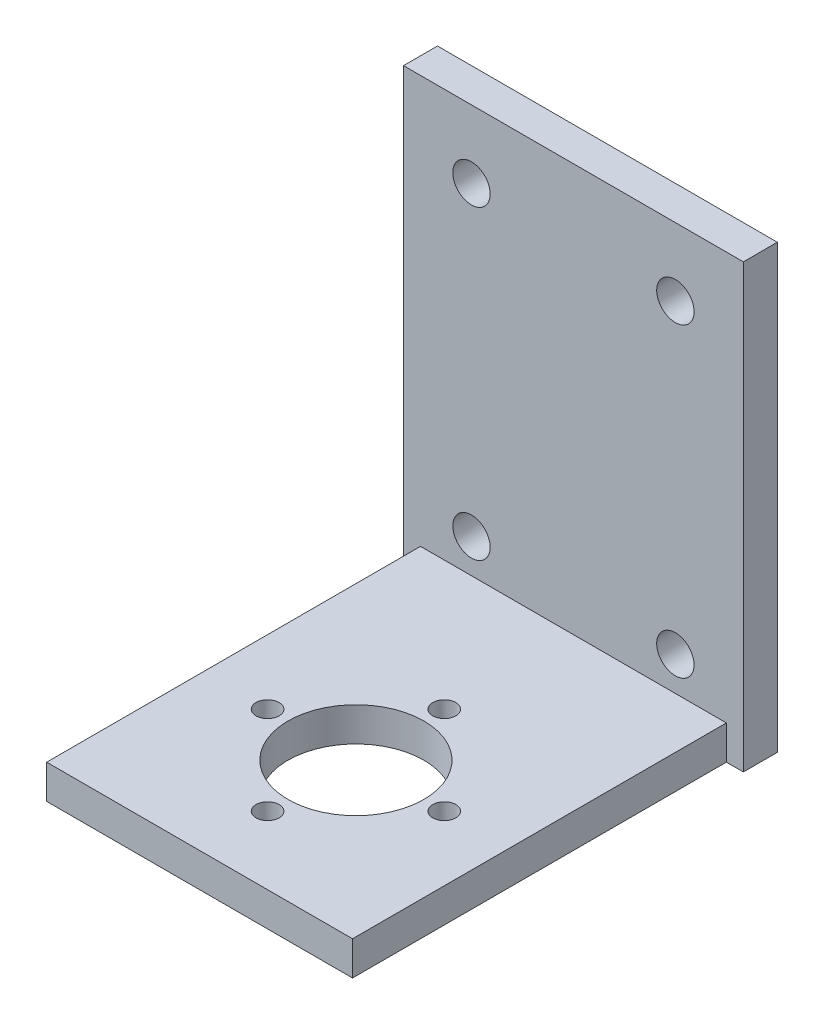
from build123d import *

# Parameters (mm, degrees)
SKETCH1_W           = 65
SKETCH1_H           = 50
BOSS_EXTRUDE1_DEPTH = 5
BOSS_EXTRUDE2_DEPTH = 55
SKETCH3_R           = 10
CUT_EXTRUDE1_DEPTH  = 92.923881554
SKETCH5_R           = 1.7
CUT_EXTRUDE2_DEPTH  = 92.923881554
SKETCH6_R           = 2.75
CUT_EXTRUDE3_DEPTH  = 69.60211367


with BuildPart() as part:
    # Sketch1 → Boss-Extrude1 (new body)
    with BuildSketch(Plane(origin=(0, 0, 0), x_dir=(0, 1, 0), z_dir=(0, 0, 1))):
        Rectangle(SKETCH1_W, SKETCH1_H)
    extrude(amount=BOSS_EXTRUDE1_DEPTH)

    # Sketch2 → Boss-Extrude2 (add)
    with BuildSketch(Plane.XY.offset(5)):
        Polygon((0, -32.5), (-22.5, -32.5), (-22.5, -27.5), (22.5, -27.5), (22.5, -32.5), align=None)
    extrude(amount=BOSS_EXTRUDE2_DEPTH)

    # Sketch3 → Cut-Extrude1 (cut, through all)
    with BuildSketch(Plane.XZ.offset(32.5)):
        with Locations(Location((0, 37, 0), (0, 0, 270))):
            Circle(SKETCH3_R)
    extrude(amount=-CUT_EXTRUDE1_DEPTH, mode=Mode.SUBTRACT)

    # Sketch5 → Cut-Extrude2 (cut, through all)
    with BuildSketch(Plane.XZ.offset(32.5)):
        with Locations(Location((0, 50, 0), (0, 0, 270))):
            Circle(SKETCH5_R)
        with Locations(Location((13, 37, 0), (0, 0, 270))):
            Circle(SKETCH5_R)
        with Locations(Location((0, 24, 0), (0, 0, 270))):
            Circle(SKETCH5_R)
        with Locations(Location((-13, 37, 0), (0, 0, 270))):
            Circle(SKETCH5_R)
    extrude(amount=-CUT_EXTRUDE2_DEPTH, mode=Mode.SUBTRACT)

    # Sketch6 → Cut-Extrude3 (cut, through all)
    with BuildSketch(Plane.XY.offset(5)):
        with Locations((-15, 22.5)):
            Circle(SKETCH6_R)
        with Locations((15, 22.5)):
            Circle(SKETCH6_R)
        with Locations((-15, -22.5)):
            Circle(SKETCH6_R)
        with Locations((15, -22.5)):
            Circle(SKETCH6_R)
    extrude(amount=-CUT_EXTRUDE3_DEPTH, mode=Mode.SUBTRACT)


solid = part.part
